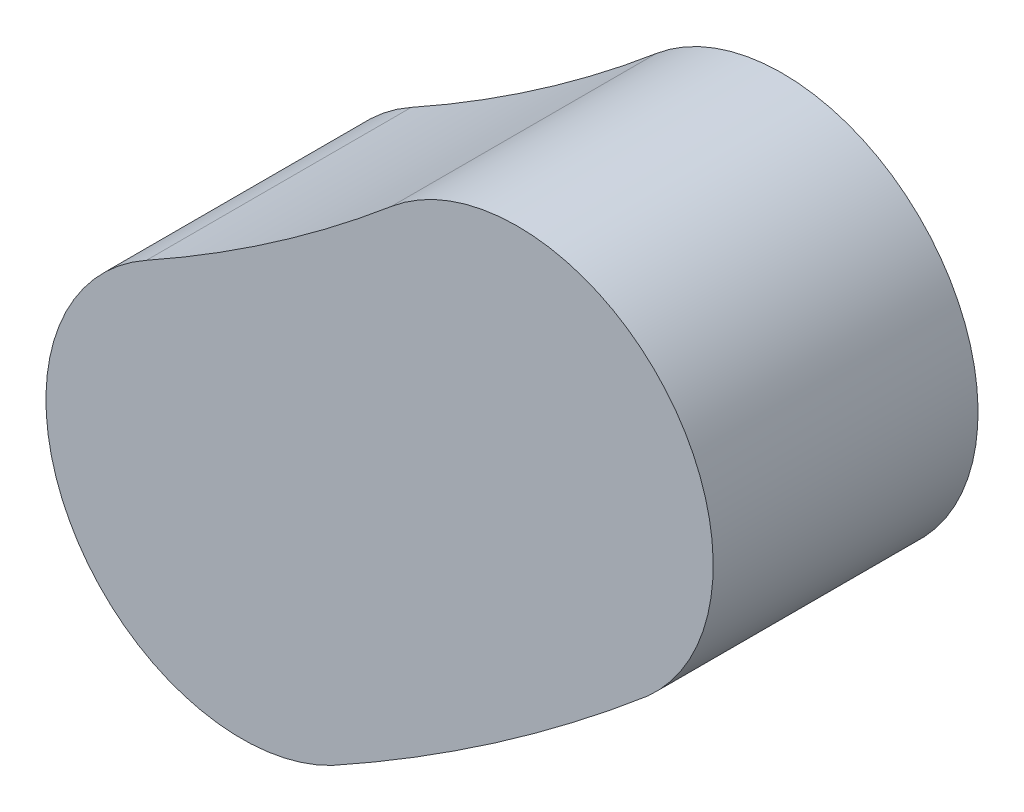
ISO-10303-21;
HEADER;
FILE_DESCRIPTION(('STEP AP214'),'2;1');
FILE_NAME('part.step','',(''),(''),'','','');
FILE_SCHEMA(('AUTOMOTIVE_DESIGN { 1 0 10303 214 1 1 1 1 }'));
ENDSEC;
DATA;
#1=APPLICATION_CONTEXT('core data for automotive mechanical design processes');
#2=APPLICATION_PROTOCOL_DEFINITION('international standard','automotive_design',2000,#1);
#3=PRODUCT_CONTEXT('',#1,'mechanical');
#4=PRODUCT('Part','Part','',(#3));
#5=PRODUCT_RELATED_PRODUCT_CATEGORY('part','',(#4));
#6=PRODUCT_DEFINITION_FORMATION('','',#4);
#7=PRODUCT_DEFINITION_CONTEXT('part definition',#1,'design');
#8=PRODUCT_DEFINITION('design','',#6,#7);
#9=PRODUCT_DEFINITION_SHAPE('','',#8);
#10=(LENGTH_UNIT() NAMED_UNIT(*) SI_UNIT(.MILLI.,.METRE.));
#11=(NAMED_UNIT(*) PLANE_ANGLE_UNIT() SI_UNIT($,.RADIAN.));
#12=(NAMED_UNIT(*) SI_UNIT($,.STERADIAN.) SOLID_ANGLE_UNIT());
#13=UNCERTAINTY_MEASURE_WITH_UNIT(LENGTH_MEASURE(1.E-05),#10,'distance_accuracy_value','');
#14=(GEOMETRIC_REPRESENTATION_CONTEXT(3) GLOBAL_UNCERTAINTY_ASSIGNED_CONTEXT((#13)) GLOBAL_UNIT_ASSIGNED_CONTEXT((#10,
#11,#12)) REPRESENTATION_CONTEXT('',''));
#15=CARTESIAN_POINT('',(0.,0.,0.));
#16=DIRECTION('',(0.,0.,1.));
#17=DIRECTION('',(1.,0.,0.));
#18=AXIS2_PLACEMENT_3D('',#15,#16,#17);
#19=CARTESIAN_POINT('',(34.0252328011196,50.4513231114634,8.));
#20=DIRECTION('',(0.,0.,-1.));
#21=DIRECTION('',(-1.,0.,0.));
#22=AXIS2_PLACEMENT_3D('',#19,#20,#21);
#23=CYLINDRICAL_SURFACE('',#22,5.91274793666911);
#24=CARTESIAN_POINT('',(34.0252328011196,50.4513231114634,0.));
#25=DIRECTION('',(0.,0.,1.));
#26=DIRECTION('',(1.,0.,0.));
#27=AXIS2_PLACEMENT_3D('',#24,#25,#26);
#28=CIRCLE('',#27,5.91274793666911);
#29=CARTESIAN_POINT('',(30.2149558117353,54.9726478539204,0.));
#30=VERTEX_POINT('',#29);
#31=CARTESIAN_POINT('',(37.9646822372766,46.0420911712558,0.));
#32=VERTEX_POINT('',#31);
#33=EDGE_CURVE('E96',#30,#32,#28,.F.);
#34=ORIENTED_EDGE('',*,*,#33,.F.);
#35=DIRECTION('',(0.,0.,-1.));
#36=VECTOR('',#35,1.);
#37=CARTESIAN_POINT('',(30.2149558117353,54.9726478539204,8.));
#38=LINE('',#37,#36);
#39=CARTESIAN_POINT('',(30.2149558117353,54.9726478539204,8.));
#40=VERTEX_POINT('',#39);
#41=EDGE_CURVE('E11',#40,#30,#38,.T.);
#42=ORIENTED_EDGE('',*,*,#41,.F.);
#43=CARTESIAN_POINT('',(34.0252328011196,50.4513231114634,8.));
#44=DIRECTION('',(0.,0.,1.));
#45=DIRECTION('',(1.,0.,0.));
#46=AXIS2_PLACEMENT_3D('',#43,#44,#45);
#47=CIRCLE('',#46,5.91274793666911);
#48=CARTESIAN_POINT('',(37.9646822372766,46.0420911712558,8.));
#49=VERTEX_POINT('',#48);
#50=EDGE_CURVE('E90',#40,#49,#47,.F.);
#51=ORIENTED_EDGE('',*,*,#50,.T.);
#52=DIRECTION('',(0.,0.,-1.));
#53=VECTOR('',#52,1.);
#54=CARTESIAN_POINT('',(37.9646822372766,46.0420911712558,8.));
#55=LINE('',#54,#53);
#56=EDGE_CURVE('E71',#49,#32,#55,.T.);
#57=ORIENTED_EDGE('',*,*,#56,.T.);
#58=EDGE_LOOP('',(#34,#42,#51,#57));
#59=FACE_BOUND('',#58,.T.);
#60=ADVANCED_FACE('F33',(#59),#23,.T.);
#61=CARTESIAN_POINT('',(2.79683503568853E-12,90.8261114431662,8.));
#62=DIRECTION('',(0.,0.,-1.));
#63=DIRECTION('',(-1.,0.,0.));
#64=AXIS2_PLACEMENT_3D('',#61,#62,#63);
#65=CYLINDRICAL_SURFACE('',#64,46.8872520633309);
#66=CARTESIAN_POINT('',(2.79683503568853E-12,90.8261114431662,0.));
#67=DIRECTION('',(0.,0.,1.));
#68=DIRECTION('',(1.,0.,0.));
#69=AXIS2_PLACEMENT_3D('',#66,#67,#68);
#70=CIRCLE('',#69,46.8872520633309);
#71=CARTESIAN_POINT('',(22.8186586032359,49.8660915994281,0.));
#72=VERTEX_POINT('',#71);
#73=EDGE_CURVE('E84',#72,#30,#70,.T.);
#74=ORIENTED_EDGE('',*,*,#73,.F.);
#75=DIRECTION('',(0.,0.,-1.));
#76=VECTOR('',#75,1.);
#77=CARTESIAN_POINT('',(22.8186586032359,49.8660915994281,8.));
#78=LINE('',#77,#76);
#79=CARTESIAN_POINT('',(22.8186586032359,49.8660915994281,8.));
#80=VERTEX_POINT('',#79);
#81=EDGE_CURVE('E41',#80,#72,#78,.T.);
#82=ORIENTED_EDGE('',*,*,#81,.F.);
#83=CARTESIAN_POINT('',(2.79683503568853E-12,90.8261114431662,8.));
#84=DIRECTION('',(0.,0.,1.));
#85=DIRECTION('',(1.,0.,0.));
#86=AXIS2_PLACEMENT_3D('',#83,#84,#85);
#87=CIRCLE('',#86,46.8872520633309);
#88=EDGE_CURVE('E82',#80,#40,#87,.T.);
#89=ORIENTED_EDGE('',*,*,#88,.T.);
#90=ORIENTED_EDGE('',*,*,#41,.T.);
#91=EDGE_LOOP('',(#74,#82,#89,#90));
#92=FACE_BOUND('',#91,.T.);
#93=ADVANCED_FACE('F80',(#92),#65,.F.);
#94=CARTESIAN_POINT('',(25.6962206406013,44.700801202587,8.));
#95=DIRECTION('',(0.,0.,-1.));
#96=DIRECTION('',(-1.,0.,0.));
#97=AXIS2_PLACEMENT_3D('',#94,#95,#96);
#98=CYLINDRICAL_SURFACE('',#97,5.91274793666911);
#99=CARTESIAN_POINT('',(25.6962206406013,44.700801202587,0.));
#100=DIRECTION('',(0.,0.,1.));
#101=DIRECTION('',(1.,0.,0.));
#102=AXIS2_PLACEMENT_3D('',#99,#100,#101);
#103=CIRCLE('',#102,5.91274793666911);
#104=CARTESIAN_POINT('',(28.4231876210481,39.4544463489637,0.));
#105=VERTEX_POINT('',#104);
#106=EDGE_CURVE('E64',#72,#105,#103,.T.);
#107=ORIENTED_EDGE('',*,*,#106,.T.);
#108=DIRECTION('',(0.,0.,-1.));
#109=VECTOR('',#108,1.);
#110=CARTESIAN_POINT('',(28.4231876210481,39.4544463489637,8.));
#111=LINE('',#110,#109);
#112=CARTESIAN_POINT('',(28.4231876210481,39.4544463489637,8.));
#113=VERTEX_POINT('',#112);
#114=EDGE_CURVE('E85',#113,#105,#111,.T.);
#115=ORIENTED_EDGE('',*,*,#114,.F.);
#116=CARTESIAN_POINT('',(25.6962206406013,44.700801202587,8.));
#117=DIRECTION('',(0.,0.,1.));
#118=DIRECTION('',(1.,0.,0.));
#119=AXIS2_PLACEMENT_3D('',#116,#117,#118);
#120=CIRCLE('',#119,5.91274793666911);
#121=EDGE_CURVE('E86',#80,#113,#120,.T.);
#122=ORIENTED_EDGE('',*,*,#121,.F.);
#123=ORIENTED_EDGE('',*,*,#81,.T.);
#124=EDGE_LOOP('',(#107,#115,#122,#123));
#125=FACE_BOUND('',#124,.T.);
#126=ADVANCED_FACE('F87',(#125),#98,.T.);
#127=CARTESIAN_POINT('',(2.79683503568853E-12,90.8261114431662,8.));
#128=DIRECTION('',(0.,0.,-1.));
#129=DIRECTION('',(-1.,0.,0.));
#130=AXIS2_PLACEMENT_3D('',#127,#128,#129);
#131=CYLINDRICAL_SURFACE('',#130,58.710523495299);
#132=CARTESIAN_POINT('',(2.79683503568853E-12,90.8261114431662,0.));
#133=DIRECTION('',(0.,0.,1.));
#134=DIRECTION('',(1.,0.,0.));
#135=AXIS2_PLACEMENT_3D('',#132,#133,#134);
#136=CIRCLE('',#135,58.710523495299);
#137=EDGE_CURVE('E92',#105,#32,#136,.T.);
#138=ORIENTED_EDGE('',*,*,#137,.T.);
#139=ORIENTED_EDGE('',*,*,#56,.F.);
#140=CARTESIAN_POINT('',(2.79683503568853E-12,90.8261114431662,8.));
#141=DIRECTION('',(0.,0.,1.));
#142=DIRECTION('',(1.,0.,0.));
#143=AXIS2_PLACEMENT_3D('',#140,#141,#142);
#144=CIRCLE('',#143,58.710523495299);
#145=EDGE_CURVE('E49',#113,#49,#144,.T.);
#146=ORIENTED_EDGE('',*,*,#145,.F.);
#147=ORIENTED_EDGE('',*,*,#114,.T.);
#148=EDGE_LOOP('',(#138,#139,#146,#147));
#149=FACE_BOUND('',#148,.T.);
#150=ADVANCED_FACE('F105',(#149),#131,.T.);
#151=CARTESIAN_POINT('',(0.,0.,8.));
#152=DIRECTION('',(0.,0.,1.));
#153=DIRECTION('',(1.,0.,0.));
#154=AXIS2_PLACEMENT_3D('',#151,#152,#153);
#155=PLANE('',#154);
#156=ORIENTED_EDGE('',*,*,#50,.F.);
#157=ORIENTED_EDGE('',*,*,#88,.F.);
#158=ORIENTED_EDGE('',*,*,#121,.T.);
#159=ORIENTED_EDGE('',*,*,#145,.T.);
#160=EDGE_LOOP('',(#156,#157,#158,#159));
#161=FACE_BOUND('',#160,.T.);
#162=ADVANCED_FACE('F89',(#161),#155,.T.);
#163=CARTESIAN_POINT('',(0.,0.,0.));
#164=DIRECTION('',(0.,0.,1.));
#165=DIRECTION('',(1.,0.,0.));
#166=AXIS2_PLACEMENT_3D('',#163,#164,#165);
#167=PLANE('',#166);
#168=ORIENTED_EDGE('',*,*,#33,.T.);
#169=ORIENTED_EDGE('',*,*,#137,.F.);
#170=ORIENTED_EDGE('',*,*,#106,.F.);
#171=ORIENTED_EDGE('',*,*,#73,.T.);
#172=EDGE_LOOP('',(#168,#169,#170,#171));
#173=FACE_BOUND('',#172,.T.);
#174=ADVANCED_FACE('F107',(#173),#167,.F.);
#175=CLOSED_SHELL('',(#60,#93,#126,#150,#162,#174));
#176=MANIFOLD_SOLID_BREP('B2',#175);
#177=ADVANCED_BREP_SHAPE_REPRESENTATION('',(#18,#176),#14);
#178=SHAPE_DEFINITION_REPRESENTATION(#9,#177);
ENDSEC;
END-ISO-10303-21;
